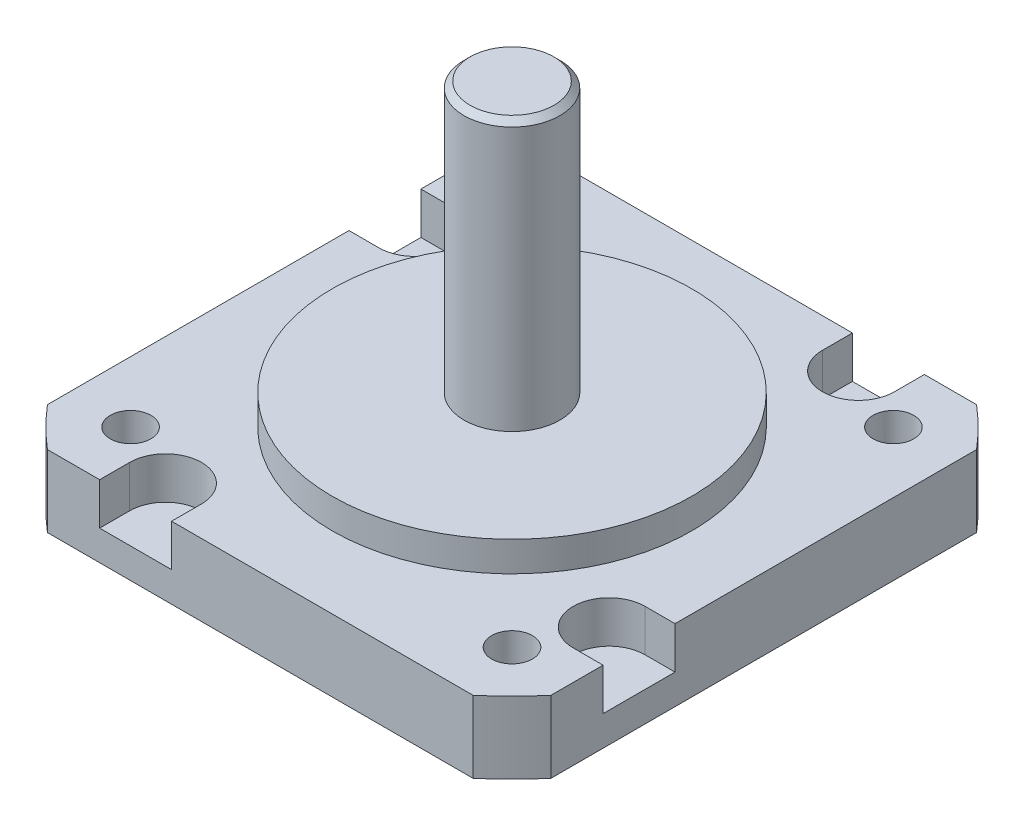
from build123d import *

# Parameters (mm, degrees)
BOSS_EXTRUDE2_DEPTH                 = 6
CUT_EXTRUDE5_DEPTH                  = 3.5
CUT_EXTRUDE6_DEPTH                  = 3.5
CUT_EXTRUDE7_DEPTH                  = 3.5
CUT_EXTRUDE8_DEPTH                  = 3.5
SKETCH48_W                          = 15
SKETCH48_H                          = 2.5
SKETCH51_W                          = 1.7
SKETCH51_H                          = 31
F_3_4_3_4_DIAMETER_HOLE2_AT_2_COUNT = 2
F_3_4_3_4_DIAMETER_HOLE2_AT_2_PITCH = 31.819805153
F_3_4_3_4_DIAMETER_HOLE2_AT_3_COUNT = 2
F_3_4_3_4_DIAMETER_HOLE2_AT_3_PITCH = 45
F_3_4_3_4_DIAMETER_HOLE2_AT_4_COUNT = 2
F_3_4_3_4_DIAMETER_HOLE2_AT_4_PITCH = 31.819805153


with BuildPart() as part:
    # Sketch14 → Revolve2 (revolve)
    with BuildSketch(Plane(origin=(0, 0, 0), x_dir=(-1, 0, 0), z_dir=(0, 0, -1)), mode=Mode.PRIVATE) as revolve2_sk:
        Polygon((-4, 7.5), (0, 7.5), (0, 38.5), (-3.49992186, 38.5), (-4, 37.999910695), align=None)
    revolve(revolve2_sk.sketch.rotate(Axis((0, 7.5, 0), (0, 1, 0)), 270), axis=Axis((0, 7.5, 0), (0, 1, 0)))


with BuildPart() as body_2:
    # Sketch19 → Boss-Extrude2 (new body)
    with BuildSketch(Plane(origin=(0, 13.5, 0), x_dir=(-1, 0, 0), z_dir=(0, 1, 0))):
        with BuildLine():
            Line((17.755, 21.000237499), (-17.755, 21.000237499))
            ThreePointArc((-17.755, 21.000237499), (-19.445436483, 19.445436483), (-21.000237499, 17.755))
            Line((-21.000237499, 17.755), (-21.000237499, -17.755))
            ThreePointArc((-21.000237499, -17.755), (-19.445436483, -19.445436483), (-17.755, -21.000237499))
            Line((-17.755, -21.000237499), (17.755, -21.000237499))
            ThreePointArc((17.755, -21.000237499), (19.445436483, -19.445436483), (21.000237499, -17.755))
            Line((21.000237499, -17.755), (21.000237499, 17.755))
            ThreePointArc((21.000237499, 17.755), (19.445436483, 19.445436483), (17.755, 21.000237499))
        make_face()
    extrude(amount=-BOSS_EXTRUDE2_DEPTH)

    # Sketch25 → Cut-Extrude5 (cut)
    with BuildSketch(Plane(origin=(0, 13.5, 0), x_dir=(-1, 0, 0), z_dir=(0, 1, 0))):
        with BuildLine():
            Line((7.4, 21.000237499), (7.4, 18.500237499))
            ThreePointArc((7.4, 18.500237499), (10.4, 15.500237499), (13.4, 18.500237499))
            Line((13.4, 18.500237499), (13.4, 21.000237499))
            Line((13.4, 21.000237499), (7.4, 21.000237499))
        make_face()
    extrude(amount=-CUT_EXTRUDE5_DEPTH, mode=Mode.SUBTRACT)

    # Sketch31 → Cut-Extrude6 (cut)
    with BuildSketch(Plane(origin=(0, 13.5, 0), x_dir=(-1, 0, 0), z_dir=(0, 1, 0))):
        with BuildLine():
            Line((-21.000237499, 7.4), (-18.500237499, 7.4))
            ThreePointArc((-18.500237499, 7.4), (-15.500237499, 10.4), (-18.500237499, 13.4))
            Line((-18.500237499, 13.4), (-21.000237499, 13.4))
            Line((-21.000237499, 13.4), (-21.000237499, 7.4))
        make_face()
    extrude(amount=-CUT_EXTRUDE6_DEPTH, mode=Mode.SUBTRACT)

    # Sketch37 → Cut-Extrude7 (cut)
    with BuildSketch(Plane(origin=(0, 13.5, 0), x_dir=(-1, 0, 0), z_dir=(0, 1, 0))):
        with BuildLine():
            Line((-7.4, -21.000237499), (-7.4, -18.500237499))
            ThreePointArc((-7.4, -18.500237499), (-10.4, -15.500237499), (-13.4, -18.500237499))
            Line((-13.4, -18.500237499), (-13.4, -21.000237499))
            Line((-13.4, -21.000237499), (-7.4, -21.000237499))
        make_face()
    extrude(amount=-CUT_EXTRUDE7_DEPTH, mode=Mode.SUBTRACT)

    # Sketch43 → Cut-Extrude8 (cut)
    with BuildSketch(Plane(origin=(0, 13.5, 0), x_dir=(-1, 0, 0), z_dir=(0, 1, 0))):
        with BuildLine():
            Line((21.000237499, -7.4), (18.500237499, -7.4))
            ThreePointArc((18.500237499, -7.4), (15.500237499, -10.4), (18.500237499, -13.4))
            Line((18.500237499, -13.4), (21.000237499, -13.4))
            Line((21.000237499, -13.4), (21.000237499, -7.4))
        make_face()
    extrude(amount=-CUT_EXTRUDE8_DEPTH, mode=Mode.SUBTRACT)


with BuildPart() as body_3:
    # Sketch48 → Revolve3 (revolve)
    with BuildSketch(Plane(origin=(0, 0, 0), x_dir=(-1, 0, 0), z_dir=(0, 0, -1)), mode=Mode.PRIVATE) as revolve3_sk:
        with Locations((-7.5, 14.75)):
            Rectangle(SKETCH48_W, SKETCH48_H)
    revolve(revolve3_sk.sketch.rotate(Axis((0, 13.5, 0), (0, 1, 0)), 270), axis=Axis((0, 13.5, 0), (0, 1, 0)))


with BuildPart() as f_0_5_0_5_diameter_hole1_tool:
    # Sketch49 → 0.5 _0.5_ Diameter Hole1 (revolve)
    with BuildSketch(Plane(origin=(0, 7.5, 0), x_dir=(0, 0, -1), z_dir=(1, 0, 0))):
        Polygon((0, 0), (0, 0.650215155), (0.25, 0.5), (0.25, 0), align=None)
    revolve(axis=Axis((0, 1.15, 0), (0, 1, 0)))


with BuildPart() as part_1:
    add(part.part)

    # 0.5 _0.5_ Diameter Hole1: cut by f_0_5_0_5_diameter_hole1_tool
    add(f_0_5_0_5_diameter_hole1_tool.part, mode=Mode.SUBTRACT)


with BuildPart() as body_2_1:
    add(body_2.part)

    # 0.5 _0.5_ Diameter Hole1: cut by f_0_5_0_5_diameter_hole1_tool
    add(f_0_5_0_5_diameter_hole1_tool.part, mode=Mode.SUBTRACT)

    # Sketch51 → 3.4 _3.4_ Diameter Hole2 (revolve, cut)
    with BuildSketch(Plane(origin=(15.909902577, 7.5, -15.909902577), x_dir=(0, 0, -1), z_dir=(1, 0, 0))):
        with Locations((0.85, 15.5)):
            Rectangle(SKETCH51_W, SKETCH51_H)
    f_3_4_3_4_diameter_hole2 = revolve(axis=Axis((15.909902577, 1.15, -15.909902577), (0, 1, 0)), mode=Mode.SUBTRACT)

    # 3.4 _3.4_ Diameter Hole2 at 2: 3.4 _3.4_ Diameter Hole2 ×2
    with Locations(*[(-i * F_3_4_3_4_DIAMETER_HOLE2_AT_2_PITCH, 0, 0) for i in range(1, F_3_4_3_4_DIAMETER_HOLE2_AT_2_COUNT)]):
        add(f_3_4_3_4_diameter_hole2, mode=Mode.SUBTRACT)

    # 3.4 _3.4_ Diameter Hole2 at 3: 3.4 _3.4_ Diameter Hole2 ×2
    with Locations(*[Vector(-0.7071067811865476, 0, 0.7071067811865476) * (i * F_3_4_3_4_DIAMETER_HOLE2_AT_3_PITCH) for i in range(1, F_3_4_3_4_DIAMETER_HOLE2_AT_3_COUNT)]):
        add(f_3_4_3_4_diameter_hole2, mode=Mode.SUBTRACT)

    # 3.4 _3.4_ Diameter Hole2 at 4: 3.4 _3.4_ Diameter Hole2 ×2
    with Locations(*[(0, 0, i * F_3_4_3_4_DIAMETER_HOLE2_AT_4_PITCH) for i in range(1, F_3_4_3_4_DIAMETER_HOLE2_AT_4_COUNT)]):
        add(f_3_4_3_4_diameter_hole2, mode=Mode.SUBTRACT)


solid = Compound([body_3.part, part_1.part, body_2_1.part])
